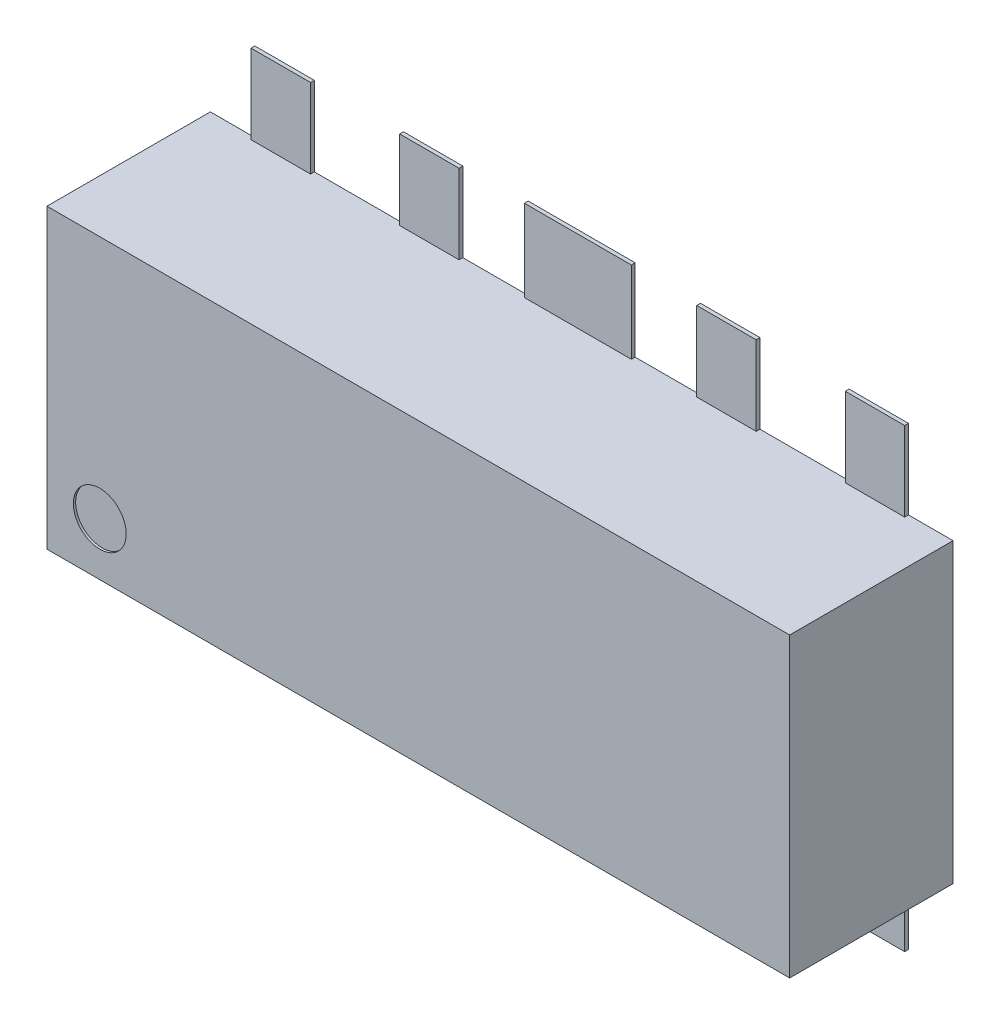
ISO-10303-21;
HEADER;
FILE_DESCRIPTION(('STEP AP214'),'2;1');
FILE_NAME('part.step','',(''),(''),'','','');
FILE_SCHEMA(('AUTOMOTIVE_DESIGN { 1 0 10303 214 1 1 1 1 }'));
ENDSEC;
DATA;
#1=APPLICATION_CONTEXT('core data for automotive mechanical design processes');
#2=APPLICATION_PROTOCOL_DEFINITION('international standard','automotive_design',2000,#1);
#3=PRODUCT_CONTEXT('',#1,'mechanical');
#4=PRODUCT('Part','Part','',(#3));
#5=PRODUCT_RELATED_PRODUCT_CATEGORY('part','',(#4));
#6=PRODUCT_DEFINITION_FORMATION('','',#4);
#7=PRODUCT_DEFINITION_CONTEXT('part definition',#1,'design');
#8=PRODUCT_DEFINITION('design','',#6,#7);
#9=PRODUCT_DEFINITION_SHAPE('','',#8);
#10=(LENGTH_UNIT() NAMED_UNIT(*) SI_UNIT(.MILLI.,.METRE.));
#11=(NAMED_UNIT(*) PLANE_ANGLE_UNIT() SI_UNIT($,.RADIAN.));
#12=(NAMED_UNIT(*) SI_UNIT($,.STERADIAN.) SOLID_ANGLE_UNIT());
#13=UNCERTAINTY_MEASURE_WITH_UNIT(LENGTH_MEASURE(1.E-05),#10,'distance_accuracy_value','');
#14=(GEOMETRIC_REPRESENTATION_CONTEXT(3) GLOBAL_UNCERTAINTY_ASSIGNED_CONTEXT((#13)) GLOBAL_UNIT_ASSIGNED_CONTEXT((#10,
#11,#12)) REPRESENTATION_CONTEXT('',''));
#15=CARTESIAN_POINT('',(0.,0.,0.));
#16=DIRECTION('',(0.,0.,1.));
#17=DIRECTION('',(1.,0.,0.));
#18=AXIS2_PLACEMENT_3D('',#15,#16,#17);
#19=CARTESIAN_POINT('',(0.,0.,0.61849));
#20=DIRECTION('',(0.,0.,1.));
#21=DIRECTION('',(1.,0.,0.));
#22=AXIS2_PLACEMENT_3D('',#19,#20,#21);
#23=PLANE('',#22);
#24=CARTESIAN_POINT('',(-1.07220000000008,-0.322200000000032,0.61849));
#25=DIRECTION('',(0.,0.,1.));
#26=DIRECTION('',(1.,0.,0.));
#27=AXIS2_PLACEMENT_3D('',#24,#25,#26);
#28=CIRCLE('',#27,0.0889);
#29=CARTESIAN_POINT('',(-0.98330000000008,-0.322200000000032,0.61849));
#30=VERTEX_POINT('',#29);
#31=EDGE_CURVE('E19',#30,#30,#28,.T.);
#32=ORIENTED_EDGE('',*,*,#31,.T.);
#33=EDGE_LOOP('',(#32));
#34=FACE_BOUND('',#33,.T.);
#35=ADVANCED_FACE('F16',(#34),#23,.T.);
#36=CARTESIAN_POINT('',(1.25000000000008,0.500000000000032,0.0762));
#37=DIRECTION('',(0.,1.,0.));
#38=DIRECTION('',(0.,0.,1.));
#39=AXIS2_PLACEMENT_3D('',#36,#37,#38);
#40=PLANE('',#39);
#41=DIRECTION('',(0.,0.,1.));
#42=VECTOR('',#41,1.);
#43=CARTESIAN_POINT('',(-0.8999982,0.500000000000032,0.0762));
#44=LINE('',#43,#42);
#45=CARTESIAN_POINT('',(-0.8999982,0.500000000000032,0.0762));
#46=VERTEX_POINT('',#45);
#47=CARTESIAN_POINT('',(-0.8999982,0.500000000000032,0.0889));
#48=VERTEX_POINT('',#47);
#49=EDGE_CURVE('E357',#46,#48,#44,.T.);
#50=ORIENTED_EDGE('',*,*,#49,.T.);
#51=DIRECTION('',(1.,0.,0.));
#52=VECTOR('',#51,1.);
#53=CARTESIAN_POINT('',(0.,0.500000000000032,0.0889));
#54=LINE('',#53,#52);
#55=CARTESIAN_POINT('',(-1.0999978,0.500000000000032,0.0889));
#56=VERTEX_POINT('',#55);
#57=EDGE_CURVE('E300',#56,#48,#54,.T.);
#58=ORIENTED_EDGE('',*,*,#57,.F.);
#59=DIRECTION('',(0.,0.,1.));
#60=VECTOR('',#59,1.);
#61=CARTESIAN_POINT('',(-1.0999978,0.500000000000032,0.0762));
#62=LINE('',#61,#60);
#63=CARTESIAN_POINT('',(-1.0999978,0.500000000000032,0.0762));
#64=VERTEX_POINT('',#63);
#65=EDGE_CURVE('E296',#56,#64,#62,.F.);
#66=ORIENTED_EDGE('',*,*,#65,.T.);
#67=DIRECTION('',(1.,0.,0.));
#68=VECTOR('',#67,1.);
#69=CARTESIAN_POINT('',(1.25000000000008,0.500000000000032,0.0762));
#70=LINE('',#69,#68);
#71=CARTESIAN_POINT('',(-1.25000000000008,0.500000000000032,0.0762));
#72=VERTEX_POINT('',#71);
#73=EDGE_CURVE('E293',#64,#72,#70,.F.);
#74=ORIENTED_EDGE('',*,*,#73,.T.);
#75=DIRECTION('',(0.,0.,1.));
#76=VECTOR('',#75,1.);
#77=CARTESIAN_POINT('',(-1.25000000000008,0.500000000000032,0.0762));
#78=LINE('',#77,#76);
#79=CARTESIAN_POINT('',(-1.25000000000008,0.500000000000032,0.62611));
#80=VERTEX_POINT('',#79);
#81=EDGE_CURVE('E320',#72,#80,#78,.T.);
#82=ORIENTED_EDGE('',*,*,#81,.T.);
#83=DIRECTION('',(1.,0.,0.));
#84=VECTOR('',#83,1.);
#85=CARTESIAN_POINT('',(0.,0.500000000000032,0.62611));
#86=LINE('',#85,#84);
#87=CARTESIAN_POINT('',(1.25000000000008,0.500000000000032,0.62611));
#88=VERTEX_POINT('',#87);
#89=EDGE_CURVE('E328',#88,#80,#86,.F.);
#90=ORIENTED_EDGE('',*,*,#89,.F.);
#91=DIRECTION('',(0.,0.,1.));
#92=VECTOR('',#91,1.);
#93=CARTESIAN_POINT('',(1.25000000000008,0.500000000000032,0.0762));
#94=LINE('',#93,#92);
#95=CARTESIAN_POINT('',(1.25000000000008,0.500000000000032,0.0762));
#96=VERTEX_POINT('',#95);
#97=EDGE_CURVE('E322',#88,#96,#94,.F.);
#98=ORIENTED_EDGE('',*,*,#97,.T.);
#99=DIRECTION('',(1.,0.,0.));
#100=VECTOR('',#99,1.);
#101=CARTESIAN_POINT('',(1.25000000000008,0.500000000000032,0.0762));
#102=LINE('',#101,#100);
#103=CARTESIAN_POINT('',(1.0999978,0.500000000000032,0.0762));
#104=VERTEX_POINT('',#103);
#105=EDGE_CURVE('E383',#96,#104,#102,.F.);
#106=ORIENTED_EDGE('',*,*,#105,.T.);
#107=DIRECTION('',(0.,0.,1.));
#108=VECTOR('',#107,1.);
#109=CARTESIAN_POINT('',(1.0999978,0.500000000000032,0.0762));
#110=LINE('',#109,#108);
#111=CARTESIAN_POINT('',(1.0999978,0.500000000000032,0.0889));
#112=VERTEX_POINT('',#111);
#113=EDGE_CURVE('E381',#104,#112,#110,.T.);
#114=ORIENTED_EDGE('',*,*,#113,.T.);
#115=DIRECTION('',(1.,0.,0.));
#116=VECTOR('',#115,1.);
#117=CARTESIAN_POINT('',(0.,0.500000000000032,0.0889));
#118=LINE('',#117,#116);
#119=CARTESIAN_POINT('',(0.8999982,0.500000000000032,0.0889));
#120=VERTEX_POINT('',#119);
#121=EDGE_CURVE('E354',#120,#112,#118,.T.);
#122=ORIENTED_EDGE('',*,*,#121,.F.);
#123=DIRECTION('',(0.,0.,1.));
#124=VECTOR('',#123,1.);
#125=CARTESIAN_POINT('',(0.8999982,0.500000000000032,0.0762));
#126=LINE('',#125,#124);
#127=CARTESIAN_POINT('',(0.8999982,0.500000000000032,0.0762));
#128=VERTEX_POINT('',#127);
#129=EDGE_CURVE('E379',#120,#128,#126,.F.);
#130=ORIENTED_EDGE('',*,*,#129,.T.);
#131=DIRECTION('',(1.,0.,0.));
#132=VECTOR('',#131,1.);
#133=CARTESIAN_POINT('',(1.25000000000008,0.500000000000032,0.0762));
#134=LINE('',#133,#132);
#135=CARTESIAN_POINT('',(0.5999988,0.500000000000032,0.0762));
#136=VERTEX_POINT('',#135);
#137=EDGE_CURVE('E377',#128,#136,#134,.F.);
#138=ORIENTED_EDGE('',*,*,#137,.T.);
#139=DIRECTION('',(0.,0.,1.));
#140=VECTOR('',#139,1.);
#141=CARTESIAN_POINT('',(0.5999988,0.500000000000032,0.0762));
#142=LINE('',#141,#140);
#143=CARTESIAN_POINT('',(0.5999988,0.500000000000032,0.0889));
#144=VERTEX_POINT('',#143);
#145=EDGE_CURVE('E375',#136,#144,#142,.T.);
#146=ORIENTED_EDGE('',*,*,#145,.T.);
#147=DIRECTION('',(1.,0.,0.));
#148=VECTOR('',#147,1.);
#149=CARTESIAN_POINT('',(0.,0.500000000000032,0.0889));
#150=LINE('',#149,#148);
#151=CARTESIAN_POINT('',(0.3999992,0.500000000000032,0.0889));
#152=VERTEX_POINT('',#151);
#153=EDGE_CURVE('E351',#152,#144,#150,.T.);
#154=ORIENTED_EDGE('',*,*,#153,.F.);
#155=DIRECTION('',(0.,0.,1.));
#156=VECTOR('',#155,1.);
#157=CARTESIAN_POINT('',(0.3999992,0.500000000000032,0.0762));
#158=LINE('',#157,#156);
#159=CARTESIAN_POINT('',(0.3999992,0.500000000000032,0.0762));
#160=VERTEX_POINT('',#159);
#161=EDGE_CURVE('E373',#152,#160,#158,.F.);
#162=ORIENTED_EDGE('',*,*,#161,.T.);
#163=DIRECTION('',(1.,0.,0.));
#164=VECTOR('',#163,1.);
#165=CARTESIAN_POINT('',(1.25000000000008,0.500000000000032,0.0762));
#166=LINE('',#165,#164);
#167=CARTESIAN_POINT('',(0.1800098,0.500000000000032,0.0762));
#168=VERTEX_POINT('',#167);
#169=EDGE_CURVE('E371',#160,#168,#166,.F.);
#170=ORIENTED_EDGE('',*,*,#169,.T.);
#171=DIRECTION('',(0.,0.,1.));
#172=VECTOR('',#171,1.);
#173=CARTESIAN_POINT('',(0.1800098,0.500000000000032,0.0762));
#174=LINE('',#173,#172);
#175=CARTESIAN_POINT('',(0.1800098,0.500000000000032,0.0889));
#176=VERTEX_POINT('',#175);
#177=EDGE_CURVE('E369',#168,#176,#174,.T.);
#178=ORIENTED_EDGE('',*,*,#177,.T.);
#179=DIRECTION('',(1.,0.,0.));
#180=VECTOR('',#179,1.);
#181=CARTESIAN_POINT('',(0.,0.500000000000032,0.0889));
#182=LINE('',#181,#180);
#183=CARTESIAN_POINT('',(-0.1800098,0.500000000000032,0.0889));
#184=VERTEX_POINT('',#183);
#185=EDGE_CURVE('E348',#184,#176,#182,.T.);
#186=ORIENTED_EDGE('',*,*,#185,.F.);
#187=DIRECTION('',(0.,0.,1.));
#188=VECTOR('',#187,1.);
#189=CARTESIAN_POINT('',(-0.1800098,0.500000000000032,0.0762));
#190=LINE('',#189,#188);
#191=CARTESIAN_POINT('',(-0.1800098,0.500000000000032,0.0762));
#192=VERTEX_POINT('',#191);
#193=EDGE_CURVE('E367',#184,#192,#190,.F.);
#194=ORIENTED_EDGE('',*,*,#193,.T.);
#195=DIRECTION('',(1.,0.,0.));
#196=VECTOR('',#195,1.);
#197=CARTESIAN_POINT('',(1.25000000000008,0.500000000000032,0.0762));
#198=LINE('',#197,#196);
#199=CARTESIAN_POINT('',(-0.3999992,0.500000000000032,0.0762));
#200=VERTEX_POINT('',#199);
#201=EDGE_CURVE('E365',#192,#200,#198,.F.);
#202=ORIENTED_EDGE('',*,*,#201,.T.);
#203=DIRECTION('',(0.,0.,1.));
#204=VECTOR('',#203,1.);
#205=CARTESIAN_POINT('',(-0.3999992,0.500000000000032,0.0762));
#206=LINE('',#205,#204);
#207=CARTESIAN_POINT('',(-0.3999992,0.500000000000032,0.0889));
#208=VERTEX_POINT('',#207);
#209=EDGE_CURVE('E363',#200,#208,#206,.T.);
#210=ORIENTED_EDGE('',*,*,#209,.T.);
#211=DIRECTION('',(1.,0.,0.));
#212=VECTOR('',#211,1.);
#213=CARTESIAN_POINT('',(0.,0.500000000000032,0.0889));
#214=LINE('',#213,#212);
#215=CARTESIAN_POINT('',(-0.5999988,0.500000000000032,0.0889));
#216=VERTEX_POINT('',#215);
#217=EDGE_CURVE('E345',#216,#208,#214,.T.);
#218=ORIENTED_EDGE('',*,*,#217,.F.);
#219=DIRECTION('',(0.,0.,1.));
#220=VECTOR('',#219,1.);
#221=CARTESIAN_POINT('',(-0.5999988,0.500000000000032,0.0762));
#222=LINE('',#221,#220);
#223=CARTESIAN_POINT('',(-0.5999988,0.500000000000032,0.0762));
#224=VERTEX_POINT('',#223);
#225=EDGE_CURVE('E361',#216,#224,#222,.F.);
#226=ORIENTED_EDGE('',*,*,#225,.T.);
#227=DIRECTION('',(1.,0.,0.));
#228=VECTOR('',#227,1.);
#229=CARTESIAN_POINT('',(1.25000000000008,0.500000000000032,0.0762));
#230=LINE('',#229,#228);
#231=EDGE_CURVE('E359',#224,#46,#230,.F.);
#232=ORIENTED_EDGE('',*,*,#231,.T.);
#233=EDGE_LOOP('',(#50,#58,#66,#74,#82,#90,#98,#106,#114,#122,#130,#138,#146,#154,#162,#170,
#178,#186,#194,#202,#210,#218,#226,#232));
#234=FACE_BOUND('',#233,.T.);
#235=ADVANCED_FACE('F298',(#234),#40,.T.);
#236=CARTESIAN_POINT('',(-1.07220000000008,-0.322200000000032,0.62611));
#237=DIRECTION('',(0.,0.,1.));
#238=DIRECTION('',(1.,0.,0.));
#239=AXIS2_PLACEMENT_3D('',#236,#237,#238);
#240=CYLINDRICAL_SURFACE('',#239,0.0889);
#241=ORIENTED_EDGE('',*,*,#31,.F.);
#242=EDGE_LOOP('',(#241));
#243=FACE_BOUND('',#242,.T.);
#244=CARTESIAN_POINT('',(-1.07220000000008,-0.322200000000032,0.62611));
#245=DIRECTION('',(0.,0.,1.));
#246=DIRECTION('',(1.,0.,0.));
#247=AXIS2_PLACEMENT_3D('',#244,#245,#246);
#248=CIRCLE('',#247,0.0889);
#249=CARTESIAN_POINT('',(-0.98330000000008,-0.322200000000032,0.62611));
#250=VERTEX_POINT('',#249);
#251=EDGE_CURVE('E325',#250,#250,#248,.F.);
#252=ORIENTED_EDGE('',*,*,#251,.F.);
#253=EDGE_LOOP('',(#252));
#254=FACE_BOUND('',#253,.T.);
#255=ADVANCED_FACE('F892',(#243,#254),#240,.F.);
#256=CARTESIAN_POINT('',(0.,0.,0.0889));
#257=DIRECTION('',(0.,0.,1.));
#258=DIRECTION('',(1.,0.,0.));
#259=AXIS2_PLACEMENT_3D('',#256,#257,#258);
#260=PLANE('',#259);
#261=DIRECTION('',(0.,1.,0.));
#262=VECTOR('',#261,1.);
#263=CARTESIAN_POINT('',(0.8999982,0.7670038,0.0889));
#264=LINE('',#263,#262);
#265=CARTESIAN_POINT('',(0.8999982,0.7670038,0.0889));
#266=VERTEX_POINT('',#265);
#267=EDGE_CURVE('E406',#120,#266,#264,.T.);
#268=ORIENTED_EDGE('',*,*,#267,.F.);
#269=ORIENTED_EDGE('',*,*,#121,.T.);
#270=DIRECTION('',(0.,1.,0.));
#271=VECTOR('',#270,1.);
#272=CARTESIAN_POINT('',(1.0999978,0.1070102,0.0889));
#273=LINE('',#272,#271);
#274=CARTESIAN_POINT('',(1.0999978,0.7670038,0.0889));
#275=VERTEX_POINT('',#274);
#276=EDGE_CURVE('E327',#275,#112,#273,.F.);
#277=ORIENTED_EDGE('',*,*,#276,.F.);
#278=DIRECTION('',(1.,0.,0.));
#279=VECTOR('',#278,1.);
#280=CARTESIAN_POINT('',(1.0999978,0.7670038,0.0889));
#281=LINE('',#280,#279);
#282=EDGE_CURVE('E332',#266,#275,#281,.T.);
#283=ORIENTED_EDGE('',*,*,#282,.F.);
#284=EDGE_LOOP('',(#268,#269,#277,#283));
#285=FACE_BOUND('',#284,.T.);
#286=ADVANCED_FACE('F404',(#285),#260,.T.);
#287=CARTESIAN_POINT('',(0.,0.,0.0889));
#288=DIRECTION('',(0.,0.,1.));
#289=DIRECTION('',(1.,0.,0.));
#290=AXIS2_PLACEMENT_3D('',#287,#288,#289);
#291=PLANE('',#290);
#292=DIRECTION('',(0.,1.,0.));
#293=VECTOR('',#292,1.);
#294=CARTESIAN_POINT('',(0.3999992,0.7670038,0.0889));
#295=LINE('',#294,#293);
#296=CARTESIAN_POINT('',(0.3999992,0.7670038,0.0889));
#297=VERTEX_POINT('',#296);
#298=EDGE_CURVE('E558',#152,#297,#295,.T.);
#299=ORIENTED_EDGE('',*,*,#298,.F.);
#300=ORIENTED_EDGE('',*,*,#153,.T.);
#301=DIRECTION('',(0.,1.,0.));
#302=VECTOR('',#301,1.);
#303=CARTESIAN_POINT('',(0.5999988,0.1070102,0.0889));
#304=LINE('',#303,#302);
#305=CARTESIAN_POINT('',(0.5999988,0.7670038,0.0889));
#306=VERTEX_POINT('',#305);
#307=EDGE_CURVE('E412',#306,#144,#304,.F.);
#308=ORIENTED_EDGE('',*,*,#307,.F.);
#309=DIRECTION('',(1.,0.,0.));
#310=VECTOR('',#309,1.);
#311=CARTESIAN_POINT('',(0.5999988,0.7670038,0.0889));
#312=LINE('',#311,#310);
#313=EDGE_CURVE('E562',#297,#306,#312,.T.);
#314=ORIENTED_EDGE('',*,*,#313,.F.);
#315=EDGE_LOOP('',(#299,#300,#308,#314));
#316=FACE_BOUND('',#315,.T.);
#317=ADVANCED_FACE('F572',(#316),#291,.T.);
#318=CARTESIAN_POINT('',(0.,0.,0.0889));
#319=DIRECTION('',(0.,0.,1.));
#320=DIRECTION('',(1.,0.,0.));
#321=AXIS2_PLACEMENT_3D('',#318,#319,#320);
#322=PLANE('',#321);
#323=DIRECTION('',(0.,1.,0.));
#324=VECTOR('',#323,1.);
#325=CARTESIAN_POINT('',(-0.1800098,0.7750048,0.0889));
#326=LINE('',#325,#324);
#327=CARTESIAN_POINT('',(-0.1800098,0.7750048,0.0889));
#328=VERTEX_POINT('',#327);
#329=EDGE_CURVE('E547',#184,#328,#326,.T.);
#330=ORIENTED_EDGE('',*,*,#329,.F.);
#331=ORIENTED_EDGE('',*,*,#185,.T.);
#332=DIRECTION('',(0.,1.,0.));
#333=VECTOR('',#332,1.);
#334=CARTESIAN_POINT('',(0.1800098,-0.7750048,0.0889));
#335=LINE('',#334,#333);
#336=CARTESIAN_POINT('',(0.1800098,0.7750048,0.0889));
#337=VERTEX_POINT('',#336);
#338=EDGE_CURVE('E553',#337,#176,#335,.F.);
#339=ORIENTED_EDGE('',*,*,#338,.F.);
#340=DIRECTION('',(1.,0.,0.));
#341=VECTOR('',#340,1.);
#342=CARTESIAN_POINT('',(0.1800098,0.7750048,0.0889));
#343=LINE('',#342,#341);
#344=EDGE_CURVE('E551',#328,#337,#343,.T.);
#345=ORIENTED_EDGE('',*,*,#344,.F.);
#346=EDGE_LOOP('',(#330,#331,#339,#345));
#347=FACE_BOUND('',#346,.T.);
#348=ADVANCED_FACE('F883',(#347),#322,.T.);
#349=CARTESIAN_POINT('',(0.,0.,0.0889));
#350=DIRECTION('',(0.,0.,1.));
#351=DIRECTION('',(1.,0.,0.));
#352=AXIS2_PLACEMENT_3D('',#349,#350,#351);
#353=PLANE('',#352);
#354=DIRECTION('',(0.,1.,0.));
#355=VECTOR('',#354,1.);
#356=CARTESIAN_POINT('',(-0.5999988,0.7670038,0.0889));
#357=LINE('',#356,#355);
#358=CARTESIAN_POINT('',(-0.5999988,0.7670038,0.0889));
#359=VERTEX_POINT('',#358);
#360=EDGE_CURVE('E536',#216,#359,#357,.T.);
#361=ORIENTED_EDGE('',*,*,#360,.F.);
#362=ORIENTED_EDGE('',*,*,#217,.T.);
#363=DIRECTION('',(0.,1.,0.));
#364=VECTOR('',#363,1.);
#365=CARTESIAN_POINT('',(-0.3999992,0.1070102,0.0889));
#366=LINE('',#365,#364);
#367=CARTESIAN_POINT('',(-0.3999992,0.7670038,0.0889));
#368=VERTEX_POINT('',#367);
#369=EDGE_CURVE('E542',#368,#208,#366,.F.);
#370=ORIENTED_EDGE('',*,*,#369,.F.);
#371=DIRECTION('',(1.,0.,0.));
#372=VECTOR('',#371,1.);
#373=CARTESIAN_POINT('',(-0.3999992,0.7670038,0.0889));
#374=LINE('',#373,#372);
#375=EDGE_CURVE('E540',#359,#368,#374,.T.);
#376=ORIENTED_EDGE('',*,*,#375,.F.);
#377=EDGE_LOOP('',(#361,#362,#370,#376));
#378=FACE_BOUND('',#377,.T.);
#379=ADVANCED_FACE('F879',(#378),#353,.T.);
#380=CARTESIAN_POINT('',(0.,0.,0.0889));
#381=DIRECTION('',(0.,0.,1.));
#382=DIRECTION('',(1.,0.,0.));
#383=AXIS2_PLACEMENT_3D('',#380,#381,#382);
#384=PLANE('',#383);
#385=DIRECTION('',(0.,1.,0.));
#386=VECTOR('',#385,1.);
#387=CARTESIAN_POINT('',(-1.0999978,0.7670038,0.0889));
#388=LINE('',#387,#386);
#389=CARTESIAN_POINT('',(-1.0999978,0.7670038,0.0889));
#390=VERTEX_POINT('',#389);
#391=EDGE_CURVE('E525',#56,#390,#388,.T.);
#392=ORIENTED_EDGE('',*,*,#391,.F.);
#393=ORIENTED_EDGE('',*,*,#57,.T.);
#394=DIRECTION('',(0.,1.,0.));
#395=VECTOR('',#394,1.);
#396=CARTESIAN_POINT('',(-0.8999982,0.1070102,0.0889));
#397=LINE('',#396,#395);
#398=CARTESIAN_POINT('',(-0.8999982,0.7670038,0.0889));
#399=VERTEX_POINT('',#398);
#400=EDGE_CURVE('E531',#399,#48,#397,.F.);
#401=ORIENTED_EDGE('',*,*,#400,.F.);
#402=DIRECTION('',(1.,0.,0.));
#403=VECTOR('',#402,1.);
#404=CARTESIAN_POINT('',(-0.8999982,0.7670038,0.0889));
#405=LINE('',#404,#403);
#406=EDGE_CURVE('E529',#390,#399,#405,.T.);
#407=ORIENTED_EDGE('',*,*,#406,.F.);
#408=EDGE_LOOP('',(#392,#393,#401,#407));
#409=FACE_BOUND('',#408,.T.);
#410=ADVANCED_FACE('F874',(#409),#384,.T.);
#411=CARTESIAN_POINT('',(0.,0.,0.0889));
#412=DIRECTION('',(0.,0.,1.));
#413=DIRECTION('',(1.,0.,0.));
#414=AXIS2_PLACEMENT_3D('',#411,#412,#413);
#415=PLANE('',#414);
#416=DIRECTION('',(0.,1.,0.));
#417=VECTOR('',#416,1.);
#418=CARTESIAN_POINT('',(-0.3999992,-0.7670038,0.0889));
#419=LINE('',#418,#417);
#420=CARTESIAN_POINT('',(-0.3999992,-0.500000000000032,0.0889));
#421=VERTEX_POINT('',#420);
#422=CARTESIAN_POINT('',(-0.3999992,-0.7670038,0.0889));
#423=VERTEX_POINT('',#422);
#424=EDGE_CURVE('E504',#421,#423,#419,.F.);
#425=ORIENTED_EDGE('',*,*,#424,.F.);
#426=DIRECTION('',(1.,0.,0.));
#427=VECTOR('',#426,1.);
#428=CARTESIAN_POINT('',(-1.25000000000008,-0.500000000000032,0.0889));
#429=LINE('',#428,#427);
#430=CARTESIAN_POINT('',(-0.5999988,-0.500000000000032,0.0889));
#431=VERTEX_POINT('',#430);
#432=EDGE_CURVE('E465',#431,#421,#429,.T.);
#433=ORIENTED_EDGE('',*,*,#432,.F.);
#434=DIRECTION('',(0.,1.,0.));
#435=VECTOR('',#434,1.);
#436=CARTESIAN_POINT('',(-0.5999988,-0.1070102,0.0889));
#437=LINE('',#436,#435);
#438=CARTESIAN_POINT('',(-0.5999988,-0.7670038,0.0889));
#439=VERTEX_POINT('',#438);
#440=EDGE_CURVE('E510',#439,#431,#437,.T.);
#441=ORIENTED_EDGE('',*,*,#440,.F.);
#442=DIRECTION('',(1.,0.,0.));
#443=VECTOR('',#442,1.);
#444=CARTESIAN_POINT('',(-0.5999988,-0.7670038,0.0889));
#445=LINE('',#444,#443);
#446=EDGE_CURVE('E508',#423,#439,#445,.F.);
#447=ORIENTED_EDGE('',*,*,#446,.F.);
#448=EDGE_LOOP('',(#425,#433,#441,#447));
#449=FACE_BOUND('',#448,.T.);
#450=ADVANCED_FACE('F840',(#449),#415,.T.);
#451=CARTESIAN_POINT('',(0.,0.,0.0889));
#452=DIRECTION('',(0.,0.,1.));
#453=DIRECTION('',(1.,0.,0.));
#454=AXIS2_PLACEMENT_3D('',#451,#452,#453);
#455=PLANE('',#454);
#456=DIRECTION('',(0.,1.,0.));
#457=VECTOR('',#456,1.);
#458=CARTESIAN_POINT('',(0.1800098,-0.7750048,0.0889));
#459=LINE('',#458,#457);
#460=CARTESIAN_POINT('',(0.1800098,-0.500000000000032,0.0889));
#461=VERTEX_POINT('',#460);
#462=CARTESIAN_POINT('',(0.1800098,-0.7750048,0.0889));
#463=VERTEX_POINT('',#462);
#464=EDGE_CURVE('E494',#461,#463,#459,.F.);
#465=ORIENTED_EDGE('',*,*,#464,.F.);
#466=DIRECTION('',(1.,0.,0.));
#467=VECTOR('',#466,1.);
#468=CARTESIAN_POINT('',(-1.25000000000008,-0.500000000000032,0.0889));
#469=LINE('',#468,#467);
#470=CARTESIAN_POINT('',(-0.1800098,-0.500000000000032,0.0889));
#471=VERTEX_POINT('',#470);
#472=EDGE_CURVE('E458',#471,#461,#469,.T.);
#473=ORIENTED_EDGE('',*,*,#472,.F.);
#474=DIRECTION('',(0.,1.,0.));
#475=VECTOR('',#474,1.);
#476=CARTESIAN_POINT('',(-0.1800098,0.7750048,0.0889));
#477=LINE('',#476,#475);
#478=CARTESIAN_POINT('',(-0.1800098,-0.7750048,0.0889));
#479=VERTEX_POINT('',#478);
#480=EDGE_CURVE('E500',#479,#471,#477,.T.);
#481=ORIENTED_EDGE('',*,*,#480,.F.);
#482=DIRECTION('',(1.,0.,0.));
#483=VECTOR('',#482,1.);
#484=CARTESIAN_POINT('',(-0.1800098,-0.7750048,0.0889));
#485=LINE('',#484,#483);
#486=EDGE_CURVE('E498',#463,#479,#485,.F.);
#487=ORIENTED_EDGE('',*,*,#486,.F.);
#488=EDGE_LOOP('',(#465,#473,#481,#487));
#489=FACE_BOUND('',#488,.T.);
#490=ADVANCED_FACE('F699',(#489),#455,.T.);
#491=CARTESIAN_POINT('',(0.,0.,0.0889));
#492=DIRECTION('',(0.,0.,1.));
#493=DIRECTION('',(1.,0.,0.));
#494=AXIS2_PLACEMENT_3D('',#491,#492,#493);
#495=PLANE('',#494);
#496=DIRECTION('',(0.,1.,0.));
#497=VECTOR('',#496,1.);
#498=CARTESIAN_POINT('',(0.5999988,-0.7670038,0.0889));
#499=LINE('',#498,#497);
#500=CARTESIAN_POINT('',(0.5999988,-0.500000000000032,0.0889));
#501=VERTEX_POINT('',#500);
#502=CARTESIAN_POINT('',(0.5999988,-0.7670038,0.0889));
#503=VERTEX_POINT('',#502);
#504=EDGE_CURVE('E484',#501,#503,#499,.F.);
#505=ORIENTED_EDGE('',*,*,#504,.F.);
#506=DIRECTION('',(1.,0.,0.));
#507=VECTOR('',#506,1.);
#508=CARTESIAN_POINT('',(-1.25000000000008,-0.500000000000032,0.0889));
#509=LINE('',#508,#507);
#510=CARTESIAN_POINT('',(0.3999992,-0.500000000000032,0.0889));
#511=VERTEX_POINT('',#510);
#512=EDGE_CURVE('E451',#511,#501,#509,.T.);
#513=ORIENTED_EDGE('',*,*,#512,.F.);
#514=DIRECTION('',(0.,1.,0.));
#515=VECTOR('',#514,1.);
#516=CARTESIAN_POINT('',(0.3999992,-0.1070102,0.0889));
#517=LINE('',#516,#515);
#518=CARTESIAN_POINT('',(0.3999992,-0.7670038,0.0889));
#519=VERTEX_POINT('',#518);
#520=EDGE_CURVE('E490',#519,#511,#517,.T.);
#521=ORIENTED_EDGE('',*,*,#520,.F.);
#522=DIRECTION('',(1.,0.,0.));
#523=VECTOR('',#522,1.);
#524=CARTESIAN_POINT('',(0.3999992,-0.7670038,0.0889));
#525=LINE('',#524,#523);
#526=EDGE_CURVE('E488',#503,#519,#525,.F.);
#527=ORIENTED_EDGE('',*,*,#526,.F.);
#528=EDGE_LOOP('',(#505,#513,#521,#527));
#529=FACE_BOUND('',#528,.T.);
#530=ADVANCED_FACE('F690',(#529),#495,.T.);
#531=CARTESIAN_POINT('',(0.,0.,0.0889));
#532=DIRECTION('',(0.,0.,1.));
#533=DIRECTION('',(1.,0.,0.));
#534=AXIS2_PLACEMENT_3D('',#531,#532,#533);
#535=PLANE('',#534);
#536=DIRECTION('',(0.,1.,0.));
#537=VECTOR('',#536,1.);
#538=CARTESIAN_POINT('',(1.0999978,-0.7670038,0.0889));
#539=LINE('',#538,#537);
#540=CARTESIAN_POINT('',(1.0999978,-0.500000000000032,0.0889));
#541=VERTEX_POINT('',#540);
#542=CARTESIAN_POINT('',(1.0999978,-0.7670038,0.0889));
#543=VERTEX_POINT('',#542);
#544=EDGE_CURVE('E474',#541,#543,#539,.F.);
#545=ORIENTED_EDGE('',*,*,#544,.F.);
#546=DIRECTION('',(1.,0.,0.));
#547=VECTOR('',#546,1.);
#548=CARTESIAN_POINT('',(-1.25000000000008,-0.500000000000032,0.0889));
#549=LINE('',#548,#547);
#550=CARTESIAN_POINT('',(0.8999982,-0.500000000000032,0.0889));
#551=VERTEX_POINT('',#550);
#552=EDGE_CURVE('E444',#551,#541,#549,.T.);
#553=ORIENTED_EDGE('',*,*,#552,.F.);
#554=DIRECTION('',(0.,1.,0.));
#555=VECTOR('',#554,1.);
#556=CARTESIAN_POINT('',(0.8999982,-0.1070102,0.0889));
#557=LINE('',#556,#555);
#558=CARTESIAN_POINT('',(0.8999982,-0.7670038,0.0889));
#559=VERTEX_POINT('',#558);
#560=EDGE_CURVE('E480',#559,#551,#557,.T.);
#561=ORIENTED_EDGE('',*,*,#560,.F.);
#562=DIRECTION('',(1.,0.,0.));
#563=VECTOR('',#562,1.);
#564=CARTESIAN_POINT('',(0.8999982,-0.7670038,0.0889));
#565=LINE('',#564,#563);
#566=EDGE_CURVE('E478',#543,#559,#565,.F.);
#567=ORIENTED_EDGE('',*,*,#566,.F.);
#568=EDGE_LOOP('',(#545,#553,#561,#567));
#569=FACE_BOUND('',#568,.T.);
#570=ADVANCED_FACE('F687',(#569),#535,.T.);
#571=CARTESIAN_POINT('',(0.,0.,0.62611));
#572=DIRECTION('',(0.,0.,1.));
#573=DIRECTION('',(1.,0.,0.));
#574=AXIS2_PLACEMENT_3D('',#571,#572,#573);
#575=PLANE('',#574);
#576=ORIENTED_EDGE('',*,*,#251,.T.);
#577=EDGE_LOOP('',(#576));
#578=FACE_BOUND('',#577,.T.);
#579=ORIENTED_EDGE('',*,*,#89,.T.);
#580=DIRECTION('',(0.,1.,0.));
#581=VECTOR('',#580,1.);
#582=CARTESIAN_POINT('',(-1.25000000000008,0.500000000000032,0.62611));
#583=LINE('',#582,#581);
#584=CARTESIAN_POINT('',(-1.25000000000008,-0.500000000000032,0.62611));
#585=VERTEX_POINT('',#584);
#586=EDGE_CURVE('E522',#585,#80,#583,.T.);
#587=ORIENTED_EDGE('',*,*,#586,.F.);
#588=DIRECTION('',(1.,0.,0.));
#589=VECTOR('',#588,1.);
#590=CARTESIAN_POINT('',(-1.25000000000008,-0.500000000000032,0.62611));
#591=LINE('',#590,#589);
#592=CARTESIAN_POINT('',(1.25000000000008,-0.500000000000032,0.62611));
#593=VERTEX_POINT('',#592);
#594=EDGE_CURVE('E440',#593,#585,#591,.F.);
#595=ORIENTED_EDGE('',*,*,#594,.F.);
#596=DIRECTION('',(0.,1.,0.));
#597=VECTOR('',#596,1.);
#598=CARTESIAN_POINT('',(1.25000000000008,0.,0.62611));
#599=LINE('',#598,#597);
#600=EDGE_CURVE('E335',#593,#88,#599,.T.);
#601=ORIENTED_EDGE('',*,*,#600,.T.);
#602=EDGE_LOOP('',(#579,#587,#595,#601));
#603=FACE_BOUND('',#602,.T.);
#604=ADVANCED_FACE('F689',(#578,#603),#575,.T.);
#605=CARTESIAN_POINT('',(0.,0.,0.0889));
#606=DIRECTION('',(0.,0.,1.));
#607=DIRECTION('',(1.,0.,0.));
#608=AXIS2_PLACEMENT_3D('',#605,#606,#607);
#609=PLANE('',#608);
#610=DIRECTION('',(0.,1.,0.));
#611=VECTOR('',#610,1.);
#612=CARTESIAN_POINT('',(-0.8999982,-0.7670038,0.0889));
#613=LINE('',#612,#611);
#614=CARTESIAN_POINT('',(-0.8999982,-0.500000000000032,0.0889));
#615=VERTEX_POINT('',#614);
#616=CARTESIAN_POINT('',(-0.8999982,-0.7670038,0.0889));
#617=VERTEX_POINT('',#616);
#618=EDGE_CURVE('E514',#615,#617,#613,.F.);
#619=ORIENTED_EDGE('',*,*,#618,.F.);
#620=DIRECTION('',(1.,0.,0.));
#621=VECTOR('',#620,1.);
#622=CARTESIAN_POINT('',(-1.25000000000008,-0.500000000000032,0.0889));
#623=LINE('',#622,#621);
#624=CARTESIAN_POINT('',(-1.0999978,-0.500000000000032,0.0889));
#625=VERTEX_POINT('',#624);
#626=EDGE_CURVE('E432',#625,#615,#623,.T.);
#627=ORIENTED_EDGE('',*,*,#626,.F.);
#628=DIRECTION('',(0.,1.,0.));
#629=VECTOR('',#628,1.);
#630=CARTESIAN_POINT('',(-1.0999978,-0.1070102,0.0889));
#631=LINE('',#630,#629);
#632=CARTESIAN_POINT('',(-1.0999978,-0.7670038,0.0889));
#633=VERTEX_POINT('',#632);
#634=EDGE_CURVE('E520',#633,#625,#631,.T.);
#635=ORIENTED_EDGE('',*,*,#634,.F.);
#636=DIRECTION('',(1.,0.,0.));
#637=VECTOR('',#636,1.);
#638=CARTESIAN_POINT('',(-1.0999978,-0.7670038,0.0889));
#639=LINE('',#638,#637);
#640=EDGE_CURVE('E518',#617,#633,#639,.F.);
#641=ORIENTED_EDGE('',*,*,#640,.F.);
#642=EDGE_LOOP('',(#619,#627,#635,#641));
#643=FACE_BOUND('',#642,.T.);
#644=ADVANCED_FACE('F697',(#643),#609,.T.);
#645=CARTESIAN_POINT('',(1.0999978,0.1070102,0.0762));
#646=DIRECTION('',(1.,0.,0.));
#647=DIRECTION('',(0.,0.,-1.));
#648=AXIS2_PLACEMENT_3D('',#645,#646,#647);
#649=PLANE('',#648);
#650=ORIENTED_EDGE('',*,*,#276,.T.);
#651=ORIENTED_EDGE('',*,*,#113,.F.);
#652=DIRECTION('',(0.,1.,0.));
#653=VECTOR('',#652,1.);
#654=CARTESIAN_POINT('',(1.0999978,0.,0.0762));
#655=LINE('',#654,#653);
#656=CARTESIAN_POINT('',(1.0999978,0.7670038,0.0762));
#657=VERTEX_POINT('',#656);
#658=EDGE_CURVE('E391',#104,#657,#655,.T.);
#659=ORIENTED_EDGE('',*,*,#658,.T.);
#660=DIRECTION('',(0.,0.,1.));
#661=VECTOR('',#660,1.);
#662=CARTESIAN_POINT('',(1.0999978,0.7670038,0.0762));
#663=LINE('',#662,#661);
#664=EDGE_CURVE('E410',#275,#657,#663,.F.);
#665=ORIENTED_EDGE('',*,*,#664,.F.);
#666=EDGE_LOOP('',(#650,#651,#659,#665));
#667=FACE_BOUND('',#666,.T.);
#668=ADVANCED_FACE('F399',(#667),#649,.T.);
#669=CARTESIAN_POINT('',(1.0999978,0.7670038,0.0762));
#670=DIRECTION('',(0.,1.,0.));
#671=DIRECTION('',(0.,0.,1.));
#672=AXIS2_PLACEMENT_3D('',#669,#670,#671);
#673=PLANE('',#672);
#674=ORIENTED_EDGE('',*,*,#664,.T.);
#675=DIRECTION('',(1.,0.,0.));
#676=VECTOR('',#675,1.);
#677=CARTESIAN_POINT('',(0.,0.7670038,0.0762));
#678=LINE('',#677,#676);
#679=CARTESIAN_POINT('',(0.8999982,0.7670038,0.0762));
#680=VERTEX_POINT('',#679);
#681=EDGE_CURVE('E395',#657,#680,#678,.F.);
#682=ORIENTED_EDGE('',*,*,#681,.T.);
#683=DIRECTION('',(0.,0.,1.));
#684=VECTOR('',#683,1.);
#685=CARTESIAN_POINT('',(0.8999982,0.7670038,0.0762));
#686=LINE('',#685,#684);
#687=EDGE_CURVE('E409',#266,#680,#686,.F.);
#688=ORIENTED_EDGE('',*,*,#687,.F.);
#689=ORIENTED_EDGE('',*,*,#282,.T.);
#690=EDGE_LOOP('',(#674,#682,#688,#689));
#691=FACE_BOUND('',#690,.T.);
#692=ADVANCED_FACE('F417',(#691),#673,.T.);
#693=CARTESIAN_POINT('',(0.8999982,0.7670038,0.0762));
#694=DIRECTION('',(-1.,0.,0.));
#695=DIRECTION('',(0.,0.,1.));
#696=AXIS2_PLACEMENT_3D('',#693,#694,#695);
#697=PLANE('',#696);
#698=DIRECTION('',(0.,1.,0.));
#699=VECTOR('',#698,1.);
#700=CARTESIAN_POINT('',(0.8999982,0.,0.0762));
#701=LINE('',#700,#699);
#702=EDGE_CURVE('E420',#680,#128,#701,.F.);
#703=ORIENTED_EDGE('',*,*,#702,.T.);
#704=ORIENTED_EDGE('',*,*,#129,.F.);
#705=ORIENTED_EDGE('',*,*,#267,.T.);
#706=ORIENTED_EDGE('',*,*,#687,.T.);
#707=EDGE_LOOP('',(#703,#704,#705,#706));
#708=FACE_BOUND('',#707,.T.);
#709=ADVANCED_FACE('F419',(#708),#697,.T.);
#710=CARTESIAN_POINT('',(0.5999988,0.1070102,0.0762));
#711=DIRECTION('',(1.,0.,0.));
#712=DIRECTION('',(0.,0.,-1.));
#713=AXIS2_PLACEMENT_3D('',#710,#711,#712);
#714=PLANE('',#713);
#715=ORIENTED_EDGE('',*,*,#307,.T.);
#716=ORIENTED_EDGE('',*,*,#145,.F.);
#717=DIRECTION('',(0.,1.,0.));
#718=VECTOR('',#717,1.);
#719=CARTESIAN_POINT('',(0.5999988,0.,0.0762));
#720=LINE('',#719,#718);
#721=CARTESIAN_POINT('',(0.5999988,0.7670038,0.0762));
#722=VERTEX_POINT('',#721);
#723=EDGE_CURVE('E423',#136,#722,#720,.T.);
#724=ORIENTED_EDGE('',*,*,#723,.T.);
#725=DIRECTION('',(0.,0.,1.));
#726=VECTOR('',#725,1.);
#727=CARTESIAN_POINT('',(0.5999988,0.7670038,0.0762));
#728=LINE('',#727,#726);
#729=EDGE_CURVE('E560',#306,#722,#728,.F.);
#730=ORIENTED_EDGE('',*,*,#729,.F.);
#731=EDGE_LOOP('',(#715,#716,#724,#730));
#732=FACE_BOUND('',#731,.T.);
#733=ADVANCED_FACE('F568',(#732),#714,.T.);
#734=CARTESIAN_POINT('',(0.5999988,0.7670038,0.0762));
#735=DIRECTION('',(0.,1.,0.));
#736=DIRECTION('',(0.,0.,1.));
#737=AXIS2_PLACEMENT_3D('',#734,#735,#736);
#738=PLANE('',#737);
#739=ORIENTED_EDGE('',*,*,#729,.T.);
#740=DIRECTION('',(1.,0.,0.));
#741=VECTOR('',#740,1.);
#742=CARTESIAN_POINT('',(0.,0.7670038,0.0762));
#743=LINE('',#742,#741);
#744=CARTESIAN_POINT('',(0.3999992,0.7670038,0.0762));
#745=VERTEX_POINT('',#744);
#746=EDGE_CURVE('E426',#722,#745,#743,.F.);
#747=ORIENTED_EDGE('',*,*,#746,.T.);
#748=DIRECTION('',(0.,0.,1.));
#749=VECTOR('',#748,1.);
#750=CARTESIAN_POINT('',(0.3999992,0.7670038,0.0762));
#751=LINE('',#750,#749);
#752=EDGE_CURVE('E556',#297,#745,#751,.F.);
#753=ORIENTED_EDGE('',*,*,#752,.F.);
#754=ORIENTED_EDGE('',*,*,#313,.T.);
#755=EDGE_LOOP('',(#739,#747,#753,#754));
#756=FACE_BOUND('',#755,.T.);
#757=ADVANCED_FACE('F806',(#756),#738,.T.);
#758=CARTESIAN_POINT('',(0.3999992,0.7670038,0.0762));
#759=DIRECTION('',(-1.,0.,0.));
#760=DIRECTION('',(0.,0.,1.));
#761=AXIS2_PLACEMENT_3D('',#758,#759,#760);
#762=PLANE('',#761);
#763=DIRECTION('',(0.,1.,0.));
#764=VECTOR('',#763,1.);
#765=CARTESIAN_POINT('',(0.3999992,0.,0.0762));
#766=LINE('',#765,#764);
#767=EDGE_CURVE('E580',#745,#160,#766,.F.);
#768=ORIENTED_EDGE('',*,*,#767,.T.);
#769=ORIENTED_EDGE('',*,*,#161,.F.);
#770=ORIENTED_EDGE('',*,*,#298,.T.);
#771=ORIENTED_EDGE('',*,*,#752,.T.);
#772=EDGE_LOOP('',(#768,#769,#770,#771));
#773=FACE_BOUND('',#772,.T.);
#774=ADVANCED_FACE('F802',(#773),#762,.T.);
#775=CARTESIAN_POINT('',(0.1800098,-0.7750048,0.0762));
#776=DIRECTION('',(1.,0.,0.));
#777=DIRECTION('',(0.,0.,-1.));
#778=AXIS2_PLACEMENT_3D('',#775,#776,#777);
#779=PLANE('',#778);
#780=ORIENTED_EDGE('',*,*,#338,.T.);
#781=ORIENTED_EDGE('',*,*,#177,.F.);
#782=DIRECTION('',(0.,1.,0.));
#783=VECTOR('',#782,1.);
#784=CARTESIAN_POINT('',(0.1800098,0.,0.0762));
#785=LINE('',#784,#783);
#786=CARTESIAN_POINT('',(0.1800098,0.7750048,0.0762));
#787=VERTEX_POINT('',#786);
#788=EDGE_CURVE('E582',#168,#787,#785,.T.);
#789=ORIENTED_EDGE('',*,*,#788,.T.);
#790=DIRECTION('',(0.,0.,1.));
#791=VECTOR('',#790,1.);
#792=CARTESIAN_POINT('',(0.1800098,0.7750048,0.0762));
#793=LINE('',#792,#791);
#794=EDGE_CURVE('E549',#337,#787,#793,.F.);
#795=ORIENTED_EDGE('',*,*,#794,.F.);
#796=EDGE_LOOP('',(#780,#781,#789,#795));
#797=FACE_BOUND('',#796,.T.);
#798=ADVANCED_FACE('F798',(#797),#779,.T.);
#799=CARTESIAN_POINT('',(0.1800098,0.7750048,0.0762));
#800=DIRECTION('',(0.,1.,0.));
#801=DIRECTION('',(0.,0.,1.));
#802=AXIS2_PLACEMENT_3D('',#799,#800,#801);
#803=PLANE('',#802);
#804=ORIENTED_EDGE('',*,*,#794,.T.);
#805=DIRECTION('',(1.,0.,0.));
#806=VECTOR('',#805,1.);
#807=CARTESIAN_POINT('',(0.,0.7750048,0.0762));
#808=LINE('',#807,#806);
#809=CARTESIAN_POINT('',(-0.1800098,0.7750048,0.0762));
#810=VERTEX_POINT('',#809);
#811=EDGE_CURVE('E587',#787,#810,#808,.F.);
#812=ORIENTED_EDGE('',*,*,#811,.T.);
#813=DIRECTION('',(0.,0.,1.));
#814=VECTOR('',#813,1.);
#815=CARTESIAN_POINT('',(-0.1800098,0.7750048,0.0762));
#816=LINE('',#815,#814);
#817=EDGE_CURVE('E545',#328,#810,#816,.F.);
#818=ORIENTED_EDGE('',*,*,#817,.F.);
#819=ORIENTED_EDGE('',*,*,#344,.T.);
#820=EDGE_LOOP('',(#804,#812,#818,#819));
#821=FACE_BOUND('',#820,.T.);
#822=ADVANCED_FACE('F794',(#821),#803,.T.);
#823=CARTESIAN_POINT('',(-0.1800098,0.7750048,0.0762));
#824=DIRECTION('',(-1.,0.,0.));
#825=DIRECTION('',(0.,0.,1.));
#826=AXIS2_PLACEMENT_3D('',#823,#824,#825);
#827=PLANE('',#826);
#828=DIRECTION('',(0.,1.,0.));
#829=VECTOR('',#828,1.);
#830=CARTESIAN_POINT('',(-0.1800098,0.,0.0762));
#831=LINE('',#830,#829);
#832=EDGE_CURVE('E590',#810,#192,#831,.F.);
#833=ORIENTED_EDGE('',*,*,#832,.T.);
#834=ORIENTED_EDGE('',*,*,#193,.F.);
#835=ORIENTED_EDGE('',*,*,#329,.T.);
#836=ORIENTED_EDGE('',*,*,#817,.T.);
#837=EDGE_LOOP('',(#833,#834,#835,#836));
#838=FACE_BOUND('',#837,.T.);
#839=ADVANCED_FACE('F790',(#838),#827,.T.);
#840=CARTESIAN_POINT('',(-0.3999992,0.1070102,0.0762));
#841=DIRECTION('',(1.,0.,0.));
#842=DIRECTION('',(0.,0.,-1.));
#843=AXIS2_PLACEMENT_3D('',#840,#841,#842);
#844=PLANE('',#843);
#845=ORIENTED_EDGE('',*,*,#369,.T.);
#846=ORIENTED_EDGE('',*,*,#209,.F.);
#847=DIRECTION('',(0.,1.,0.));
#848=VECTOR('',#847,1.);
#849=CARTESIAN_POINT('',(-0.3999992,0.,0.0762));
#850=LINE('',#849,#848);
#851=CARTESIAN_POINT('',(-0.3999992,0.7670038,0.0762));
#852=VERTEX_POINT('',#851);
#853=EDGE_CURVE('E593',#200,#852,#850,.T.);
#854=ORIENTED_EDGE('',*,*,#853,.T.);
#855=DIRECTION('',(0.,0.,1.));
#856=VECTOR('',#855,1.);
#857=CARTESIAN_POINT('',(-0.3999992,0.7670038,0.0762));
#858=LINE('',#857,#856);
#859=EDGE_CURVE('E538',#368,#852,#858,.F.);
#860=ORIENTED_EDGE('',*,*,#859,.F.);
#861=EDGE_LOOP('',(#845,#846,#854,#860));
#862=FACE_BOUND('',#861,.T.);
#863=ADVANCED_FACE('F786',(#862),#844,.T.);
#864=CARTESIAN_POINT('',(-0.3999992,0.7670038,0.0762));
#865=DIRECTION('',(0.,1.,0.));
#866=DIRECTION('',(0.,0.,1.));
#867=AXIS2_PLACEMENT_3D('',#864,#865,#866);
#868=PLANE('',#867);
#869=ORIENTED_EDGE('',*,*,#859,.T.);
#870=DIRECTION('',(1.,0.,0.));
#871=VECTOR('',#870,1.);
#872=CARTESIAN_POINT('',(0.,0.7670038,0.0762));
#873=LINE('',#872,#871);
#874=CARTESIAN_POINT('',(-0.5999988,0.7670038,0.0762));
#875=VERTEX_POINT('',#874);
#876=EDGE_CURVE('E596',#852,#875,#873,.F.);
#877=ORIENTED_EDGE('',*,*,#876,.T.);
#878=DIRECTION('',(0.,0.,1.));
#879=VECTOR('',#878,1.);
#880=CARTESIAN_POINT('',(-0.5999988,0.7670038,0.0762));
#881=LINE('',#880,#879);
#882=EDGE_CURVE('E534',#359,#875,#881,.F.);
#883=ORIENTED_EDGE('',*,*,#882,.F.);
#884=ORIENTED_EDGE('',*,*,#375,.T.);
#885=EDGE_LOOP('',(#869,#877,#883,#884));
#886=FACE_BOUND('',#885,.T.);
#887=ADVANCED_FACE('F782',(#886),#868,.T.);
#888=CARTESIAN_POINT('',(-0.5999988,0.7670038,0.0762));
#889=DIRECTION('',(-1.,0.,0.));
#890=DIRECTION('',(0.,0.,1.));
#891=AXIS2_PLACEMENT_3D('',#888,#889,#890);
#892=PLANE('',#891);
#893=DIRECTION('',(0.,1.,0.));
#894=VECTOR('',#893,1.);
#895=CARTESIAN_POINT('',(-0.5999988,0.,0.0762));
#896=LINE('',#895,#894);
#897=EDGE_CURVE('E599',#875,#224,#896,.F.);
#898=ORIENTED_EDGE('',*,*,#897,.T.);
#899=ORIENTED_EDGE('',*,*,#225,.F.);
#900=ORIENTED_EDGE('',*,*,#360,.T.);
#901=ORIENTED_EDGE('',*,*,#882,.T.);
#902=EDGE_LOOP('',(#898,#899,#900,#901));
#903=FACE_BOUND('',#902,.T.);
#904=ADVANCED_FACE('F778',(#903),#892,.T.);
#905=CARTESIAN_POINT('',(-0.8999982,0.1070102,0.0762));
#906=DIRECTION('',(1.,0.,0.));
#907=DIRECTION('',(0.,0.,-1.));
#908=AXIS2_PLACEMENT_3D('',#905,#906,#907);
#909=PLANE('',#908);
#910=ORIENTED_EDGE('',*,*,#400,.T.);
#911=ORIENTED_EDGE('',*,*,#49,.F.);
#912=DIRECTION('',(0.,1.,0.));
#913=VECTOR('',#912,1.);
#914=CARTESIAN_POINT('',(-0.8999982,0.,0.0762));
#915=LINE('',#914,#913);
#916=CARTESIAN_POINT('',(-0.8999982,0.7670038,0.0762));
#917=VERTEX_POINT('',#916);
#918=EDGE_CURVE('E602',#46,#917,#915,.T.);
#919=ORIENTED_EDGE('',*,*,#918,.T.);
#920=DIRECTION('',(0.,0.,1.));
#921=VECTOR('',#920,1.);
#922=CARTESIAN_POINT('',(-0.8999982,0.7670038,0.0762));
#923=LINE('',#922,#921);
#924=EDGE_CURVE('E527',#399,#917,#923,.F.);
#925=ORIENTED_EDGE('',*,*,#924,.F.);
#926=EDGE_LOOP('',(#910,#911,#919,#925));
#927=FACE_BOUND('',#926,.T.);
#928=ADVANCED_FACE('F774',(#927),#909,.T.);
#929=CARTESIAN_POINT('',(-0.8999982,0.7670038,0.0762));
#930=DIRECTION('',(0.,1.,0.));
#931=DIRECTION('',(0.,0.,1.));
#932=AXIS2_PLACEMENT_3D('',#929,#930,#931);
#933=PLANE('',#932);
#934=ORIENTED_EDGE('',*,*,#924,.T.);
#935=DIRECTION('',(1.,0.,0.));
#936=VECTOR('',#935,1.);
#937=CARTESIAN_POINT('',(0.,0.7670038,0.0762));
#938=LINE('',#937,#936);
#939=CARTESIAN_POINT('',(-1.0999978,0.7670038,0.0762));
#940=VERTEX_POINT('',#939);
#941=EDGE_CURVE('E313',#917,#940,#938,.F.);
#942=ORIENTED_EDGE('',*,*,#941,.T.);
#943=DIRECTION('',(0.,0.,1.));
#944=VECTOR('',#943,1.);
#945=CARTESIAN_POINT('',(-1.0999978,0.7670038,0.0762));
#946=LINE('',#945,#944);
#947=EDGE_CURVE('E308',#390,#940,#946,.F.);
#948=ORIENTED_EDGE('',*,*,#947,.F.);
#949=ORIENTED_EDGE('',*,*,#406,.T.);
#950=EDGE_LOOP('',(#934,#942,#948,#949));
#951=FACE_BOUND('',#950,.T.);
#952=ADVANCED_FACE('F771',(#951),#933,.T.);
#953=CARTESIAN_POINT('',(-1.0999978,0.7670038,0.0762));
#954=DIRECTION('',(-1.,0.,0.));
#955=DIRECTION('',(0.,0.,1.));
#956=AXIS2_PLACEMENT_3D('',#953,#954,#955);
#957=PLANE('',#956);
#958=DIRECTION('',(0.,1.,0.));
#959=VECTOR('',#958,1.);
#960=CARTESIAN_POINT('',(-1.0999978,0.,0.0762));
#961=LINE('',#960,#959);
#962=EDGE_CURVE('E305',#940,#64,#961,.F.);
#963=ORIENTED_EDGE('',*,*,#962,.T.);
#964=ORIENTED_EDGE('',*,*,#65,.F.);
#965=ORIENTED_EDGE('',*,*,#391,.T.);
#966=ORIENTED_EDGE('',*,*,#947,.T.);
#967=EDGE_LOOP('',(#963,#964,#965,#966));
#968=FACE_BOUND('',#967,.T.);
#969=ADVANCED_FACE('F306',(#968),#957,.T.);
#970=CARTESIAN_POINT('',(-1.25000000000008,0.500000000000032,0.0762));
#971=DIRECTION('',(-1.,0.,0.));
#972=DIRECTION('',(0.,0.,1.));
#973=AXIS2_PLACEMENT_3D('',#970,#971,#972);
#974=PLANE('',#973);
#975=ORIENTED_EDGE('',*,*,#81,.F.);
#976=DIRECTION('',(0.,1.,0.));
#977=VECTOR('',#976,1.);
#978=CARTESIAN_POINT('',(-1.25000000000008,0.,0.0762));
#979=LINE('',#978,#977);
#980=CARTESIAN_POINT('',(-1.25000000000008,-0.500000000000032,0.0762));
#981=VERTEX_POINT('',#980);
#982=EDGE_CURVE('E312',#72,#981,#979,.F.);
#983=ORIENTED_EDGE('',*,*,#982,.T.);
#984=DIRECTION('',(0.,0.,-1.));
#985=VECTOR('',#984,1.);
#986=CARTESIAN_POINT('',(-1.25000000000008,-0.500000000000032,0.0762));
#987=LINE('',#986,#985);
#988=EDGE_CURVE('E438',#585,#981,#987,.T.);
#989=ORIENTED_EDGE('',*,*,#988,.F.);
#990=ORIENTED_EDGE('',*,*,#586,.T.);
#991=EDGE_LOOP('',(#975,#983,#989,#990));
#992=FACE_BOUND('',#991,.T.);
#993=ADVANCED_FACE('F764',(#992),#974,.T.);
#994=CARTESIAN_POINT('',(-1.0999978,-0.1070102,0.0762));
#995=DIRECTION('',(-1.,0.,0.));
#996=DIRECTION('',(0.,0.,1.));
#997=AXIS2_PLACEMENT_3D('',#994,#995,#996);
#998=PLANE('',#997);
#999=ORIENTED_EDGE('',*,*,#634,.T.);
#1000=DIRECTION('',(0.,0.,-1.));
#1001=VECTOR('',#1000,1.);
#1002=CARTESIAN_POINT('',(-1.0999978,-0.500000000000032,0.0762));
#1003=LINE('',#1002,#1001);
#1004=CARTESIAN_POINT('',(-1.0999978,-0.500000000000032,0.0762));
#1005=VERTEX_POINT('',#1004);
#1006=EDGE_CURVE('E435',#1005,#625,#1003,.F.);
#1007=ORIENTED_EDGE('',*,*,#1006,.F.);
#1008=DIRECTION('',(0.,1.,0.));
#1009=VECTOR('',#1008,1.);
#1010=CARTESIAN_POINT('',(-1.0999978,0.,0.0762));
#1011=LINE('',#1010,#1009);
#1012=CARTESIAN_POINT('',(-1.0999978,-0.7670038,0.0762));
#1013=VERTEX_POINT('',#1012);
#1014=EDGE_CURVE('E610',#1005,#1013,#1011,.F.);
#1015=ORIENTED_EDGE('',*,*,#1014,.T.);
#1016=DIRECTION('',(0.,0.,-1.));
#1017=VECTOR('',#1016,1.);
#1018=CARTESIAN_POINT('',(-1.0999978,-0.7670038,0.0762));
#1019=LINE('',#1018,#1017);
#1020=EDGE_CURVE('E516',#633,#1013,#1019,.T.);
#1021=ORIENTED_EDGE('',*,*,#1020,.F.);
#1022=EDGE_LOOP('',(#999,#1007,#1015,#1021));
#1023=FACE_BOUND('',#1022,.T.);
#1024=ADVANCED_FACE('F760',(#1023),#998,.T.);
#1025=CARTESIAN_POINT('',(-1.0999978,-0.7670038,0.0762));
#1026=DIRECTION('',(0.,-1.,0.));
#1027=DIRECTION('',(0.,0.,-1.));
#1028=AXIS2_PLACEMENT_3D('',#1025,#1026,#1027);
#1029=PLANE('',#1028);
#1030=ORIENTED_EDGE('',*,*,#1020,.T.);
#1031=DIRECTION('',(1.,0.,0.));
#1032=VECTOR('',#1031,1.);
#1033=CARTESIAN_POINT('',(0.,-0.7670038,0.0762));
#1034=LINE('',#1033,#1032);
#1035=CARTESIAN_POINT('',(-0.8999982,-0.7670038,0.0762));
#1036=VERTEX_POINT('',#1035);
#1037=EDGE_CURVE('E613',#1013,#1036,#1034,.T.);
#1038=ORIENTED_EDGE('',*,*,#1037,.T.);
#1039=DIRECTION('',(0.,0.,-1.));
#1040=VECTOR('',#1039,1.);
#1041=CARTESIAN_POINT('',(-0.8999982,-0.7670038,0.0762));
#1042=LINE('',#1041,#1040);
#1043=EDGE_CURVE('E512',#617,#1036,#1042,.T.);
#1044=ORIENTED_EDGE('',*,*,#1043,.F.);
#1045=ORIENTED_EDGE('',*,*,#640,.T.);
#1046=EDGE_LOOP('',(#1030,#1038,#1044,#1045));
#1047=FACE_BOUND('',#1046,.T.);
#1048=ADVANCED_FACE('F756',(#1047),#1029,.T.);
#1049=CARTESIAN_POINT('',(-0.8999982,-0.7670038,0.0762));
#1050=DIRECTION('',(1.,0.,0.));
#1051=DIRECTION('',(0.,0.,-1.));
#1052=AXIS2_PLACEMENT_3D('',#1049,#1050,#1051);
#1053=PLANE('',#1052);
#1054=DIRECTION('',(0.,1.,0.));
#1055=VECTOR('',#1054,1.);
#1056=CARTESIAN_POINT('',(-0.8999982,0.,0.0762));
#1057=LINE('',#1056,#1055);
#1058=CARTESIAN_POINT('',(-0.8999982,-0.500000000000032,0.0762));
#1059=VERTEX_POINT('',#1058);
#1060=EDGE_CURVE('E616',#1036,#1059,#1057,.T.);
#1061=ORIENTED_EDGE('',*,*,#1060,.T.);
#1062=DIRECTION('',(0.,0.,-1.));
#1063=VECTOR('',#1062,1.);
#1064=CARTESIAN_POINT('',(-0.8999982,-0.500000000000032,0.0762));
#1065=LINE('',#1064,#1063);
#1066=EDGE_CURVE('E470',#615,#1059,#1065,.T.);
#1067=ORIENTED_EDGE('',*,*,#1066,.F.);
#1068=ORIENTED_EDGE('',*,*,#618,.T.);
#1069=ORIENTED_EDGE('',*,*,#1043,.T.);
#1070=EDGE_LOOP('',(#1061,#1067,#1068,#1069));
#1071=FACE_BOUND('',#1070,.T.);
#1072=ADVANCED_FACE('F752',(#1071),#1053,.T.);
#1073=CARTESIAN_POINT('',(-0.5999988,-0.1070102,0.0762));
#1074=DIRECTION('',(-1.,0.,0.));
#1075=DIRECTION('',(0.,0.,1.));
#1076=AXIS2_PLACEMENT_3D('',#1073,#1074,#1075);
#1077=PLANE('',#1076);
#1078=ORIENTED_EDGE('',*,*,#440,.T.);
#1079=DIRECTION('',(0.,0.,-1.));
#1080=VECTOR('',#1079,1.);
#1081=CARTESIAN_POINT('',(-0.5999988,-0.500000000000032,0.0762));
#1082=LINE('',#1081,#1080);
#1083=CARTESIAN_POINT('',(-0.5999988,-0.500000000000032,0.0762));
#1084=VERTEX_POINT('',#1083);
#1085=EDGE_CURVE('E467',#1084,#431,#1082,.F.);
#1086=ORIENTED_EDGE('',*,*,#1085,.F.);
#1087=DIRECTION('',(0.,1.,0.));
#1088=VECTOR('',#1087,1.);
#1089=CARTESIAN_POINT('',(-0.5999988,0.,0.0762));
#1090=LINE('',#1089,#1088);
#1091=CARTESIAN_POINT('',(-0.5999988,-0.7670038,0.0762));
#1092=VERTEX_POINT('',#1091);
#1093=EDGE_CURVE('E622',#1084,#1092,#1090,.F.);
#1094=ORIENTED_EDGE('',*,*,#1093,.T.);
#1095=DIRECTION('',(0.,0.,-1.));
#1096=VECTOR('',#1095,1.);
#1097=CARTESIAN_POINT('',(-0.5999988,-0.7670038,0.0762));
#1098=LINE('',#1097,#1096);
#1099=EDGE_CURVE('E506',#439,#1092,#1098,.T.);
#1100=ORIENTED_EDGE('',*,*,#1099,.F.);
#1101=EDGE_LOOP('',(#1078,#1086,#1094,#1100));
#1102=FACE_BOUND('',#1101,.T.);
#1103=ADVANCED_FACE('F748',(#1102),#1077,.T.);
#1104=CARTESIAN_POINT('',(-0.5999988,-0.7670038,0.0762));
#1105=DIRECTION('',(0.,-1.,0.));
#1106=DIRECTION('',(0.,0.,-1.));
#1107=AXIS2_PLACEMENT_3D('',#1104,#1105,#1106);
#1108=PLANE('',#1107);
#1109=ORIENTED_EDGE('',*,*,#1099,.T.);
#1110=DIRECTION('',(1.,0.,0.));
#1111=VECTOR('',#1110,1.);
#1112=CARTESIAN_POINT('',(0.,-0.7670038,0.0762));
#1113=LINE('',#1112,#1111);
#1114=CARTESIAN_POINT('',(-0.3999992,-0.7670038,0.0762));
#1115=VERTEX_POINT('',#1114);
#1116=EDGE_CURVE('E625',#1092,#1115,#1113,.T.);
#1117=ORIENTED_EDGE('',*,*,#1116,.T.);
#1118=DIRECTION('',(0.,0.,-1.));
#1119=VECTOR('',#1118,1.);
#1120=CARTESIAN_POINT('',(-0.3999992,-0.7670038,0.0762));
#1121=LINE('',#1120,#1119);
#1122=EDGE_CURVE('E502',#423,#1115,#1121,.T.);
#1123=ORIENTED_EDGE('',*,*,#1122,.F.);
#1124=ORIENTED_EDGE('',*,*,#446,.T.);
#1125=EDGE_LOOP('',(#1109,#1117,#1123,#1124));
#1126=FACE_BOUND('',#1125,.T.);
#1127=ADVANCED_FACE('F744',(#1126),#1108,.T.);
#1128=CARTESIAN_POINT('',(-0.3999992,-0.7670038,0.0762));
#1129=DIRECTION('',(1.,0.,0.));
#1130=DIRECTION('',(0.,0.,-1.));
#1131=AXIS2_PLACEMENT_3D('',#1128,#1129,#1130);
#1132=PLANE('',#1131);
#1133=DIRECTION('',(0.,1.,0.));
#1134=VECTOR('',#1133,1.);
#1135=CARTESIAN_POINT('',(-0.3999992,0.,0.0762));
#1136=LINE('',#1135,#1134);
#1137=CARTESIAN_POINT('',(-0.3999992,-0.500000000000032,0.0762));
#1138=VERTEX_POINT('',#1137);
#1139=EDGE_CURVE('E628',#1115,#1138,#1136,.T.);
#1140=ORIENTED_EDGE('',*,*,#1139,.T.);
#1141=DIRECTION('',(0.,0.,-1.));
#1142=VECTOR('',#1141,1.);
#1143=CARTESIAN_POINT('',(-0.3999992,-0.500000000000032,0.0762));
#1144=LINE('',#1143,#1142);
#1145=EDGE_CURVE('E463',#421,#1138,#1144,.T.);
#1146=ORIENTED_EDGE('',*,*,#1145,.F.);
#1147=ORIENTED_EDGE('',*,*,#424,.T.);
#1148=ORIENTED_EDGE('',*,*,#1122,.T.);
#1149=EDGE_LOOP('',(#1140,#1146,#1147,#1148));
#1150=FACE_BOUND('',#1149,.T.);
#1151=ADVANCED_FACE('F740',(#1150),#1132,.T.);
#1152=CARTESIAN_POINT('',(-0.1800098,0.7750048,0.0762));
#1153=DIRECTION('',(-1.,0.,0.));
#1154=DIRECTION('',(0.,0.,1.));
#1155=AXIS2_PLACEMENT_3D('',#1152,#1153,#1154);
#1156=PLANE('',#1155);
#1157=ORIENTED_EDGE('',*,*,#480,.T.);
#1158=DIRECTION('',(0.,0.,-1.));
#1159=VECTOR('',#1158,1.);
#1160=CARTESIAN_POINT('',(-0.1800098,-0.500000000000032,0.0762));
#1161=LINE('',#1160,#1159);
#1162=CARTESIAN_POINT('',(-0.1800098,-0.500000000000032,0.0762));
#1163=VERTEX_POINT('',#1162);
#1164=EDGE_CURVE('E460',#1163,#471,#1161,.F.);
#1165=ORIENTED_EDGE('',*,*,#1164,.F.);
#1166=DIRECTION('',(0.,1.,0.));
#1167=VECTOR('',#1166,1.);
#1168=CARTESIAN_POINT('',(-0.1800098,0.,0.0762));
#1169=LINE('',#1168,#1167);
#1170=CARTESIAN_POINT('',(-0.1800098,-0.7750048,0.0762));
#1171=VERTEX_POINT('',#1170);
#1172=EDGE_CURVE('E634',#1163,#1171,#1169,.F.);
#1173=ORIENTED_EDGE('',*,*,#1172,.T.);
#1174=DIRECTION('',(0.,0.,-1.));
#1175=VECTOR('',#1174,1.);
#1176=CARTESIAN_POINT('',(-0.1800098,-0.7750048,0.0762));
#1177=LINE('',#1176,#1175);
#1178=EDGE_CURVE('E496',#479,#1171,#1177,.T.);
#1179=ORIENTED_EDGE('',*,*,#1178,.F.);
#1180=EDGE_LOOP('',(#1157,#1165,#1173,#1179));
#1181=FACE_BOUND('',#1180,.T.);
#1182=ADVANCED_FACE('F736',(#1181),#1156,.T.);
#1183=CARTESIAN_POINT('',(-0.1800098,-0.7750048,0.0762));
#1184=DIRECTION('',(0.,-1.,0.));
#1185=DIRECTION('',(0.,0.,-1.));
#1186=AXIS2_PLACEMENT_3D('',#1183,#1184,#1185);
#1187=PLANE('',#1186);
#1188=ORIENTED_EDGE('',*,*,#1178,.T.);
#1189=DIRECTION('',(1.,0.,0.));
#1190=VECTOR('',#1189,1.);
#1191=CARTESIAN_POINT('',(0.,-0.7750048,0.0762));
#1192=LINE('',#1191,#1190);
#1193=CARTESIAN_POINT('',(0.1800098,-0.7750048,0.0762));
#1194=VERTEX_POINT('',#1193);
#1195=EDGE_CURVE('E637',#1171,#1194,#1192,.T.);
#1196=ORIENTED_EDGE('',*,*,#1195,.T.);
#1197=DIRECTION('',(0.,0.,-1.));
#1198=VECTOR('',#1197,1.);
#1199=CARTESIAN_POINT('',(0.1800098,-0.7750048,0.0762));
#1200=LINE('',#1199,#1198);
#1201=EDGE_CURVE('E492',#463,#1194,#1200,.T.);
#1202=ORIENTED_EDGE('',*,*,#1201,.F.);
#1203=ORIENTED_EDGE('',*,*,#486,.T.);
#1204=EDGE_LOOP('',(#1188,#1196,#1202,#1203));
#1205=FACE_BOUND('',#1204,.T.);
#1206=ADVANCED_FACE('F732',(#1205),#1187,.T.);
#1207=CARTESIAN_POINT('',(0.1800098,-0.7750048,0.0762));
#1208=DIRECTION('',(1.,0.,0.));
#1209=DIRECTION('',(0.,0.,-1.));
#1210=AXIS2_PLACEMENT_3D('',#1207,#1208,#1209);
#1211=PLANE('',#1210);
#1212=DIRECTION('',(0.,1.,0.));
#1213=VECTOR('',#1212,1.);
#1214=CARTESIAN_POINT('',(0.1800098,0.,0.0762));
#1215=LINE('',#1214,#1213);
#1216=CARTESIAN_POINT('',(0.1800098,-0.500000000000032,0.0762));
#1217=VERTEX_POINT('',#1216);
#1218=EDGE_CURVE('E640',#1194,#1217,#1215,.T.);
#1219=ORIENTED_EDGE('',*,*,#1218,.T.);
#1220=DIRECTION('',(0.,0.,-1.));
#1221=VECTOR('',#1220,1.);
#1222=CARTESIAN_POINT('',(0.1800098,-0.500000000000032,0.0762));
#1223=LINE('',#1222,#1221);
#1224=EDGE_CURVE('E456',#461,#1217,#1223,.T.);
#1225=ORIENTED_EDGE('',*,*,#1224,.F.);
#1226=ORIENTED_EDGE('',*,*,#464,.T.);
#1227=ORIENTED_EDGE('',*,*,#1201,.T.);
#1228=EDGE_LOOP('',(#1219,#1225,#1226,#1227));
#1229=FACE_BOUND('',#1228,.T.);
#1230=ADVANCED_FACE('F728',(#1229),#1211,.T.);
#1231=CARTESIAN_POINT('',(0.3999992,-0.1070102,0.0762));
#1232=DIRECTION('',(-1.,0.,0.));
#1233=DIRECTION('',(0.,0.,1.));
#1234=AXIS2_PLACEMENT_3D('',#1231,#1232,#1233);
#1235=PLANE('',#1234);
#1236=ORIENTED_EDGE('',*,*,#520,.T.);
#1237=DIRECTION('',(0.,0.,-1.));
#1238=VECTOR('',#1237,1.);
#1239=CARTESIAN_POINT('',(0.3999992,-0.500000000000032,0.0762));
#1240=LINE('',#1239,#1238);
#1241=CARTESIAN_POINT('',(0.3999992,-0.500000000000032,0.0762));
#1242=VERTEX_POINT('',#1241);
#1243=EDGE_CURVE('E453',#1242,#511,#1240,.F.);
#1244=ORIENTED_EDGE('',*,*,#1243,.F.);
#1245=DIRECTION('',(0.,1.,0.));
#1246=VECTOR('',#1245,1.);
#1247=CARTESIAN_POINT('',(0.3999992,0.,0.0762));
#1248=LINE('',#1247,#1246);
#1249=CARTESIAN_POINT('',(0.3999992,-0.7670038,0.0762));
#1250=VERTEX_POINT('',#1249);
#1251=EDGE_CURVE('E646',#1242,#1250,#1248,.F.);
#1252=ORIENTED_EDGE('',*,*,#1251,.T.);
#1253=DIRECTION('',(0.,0.,-1.));
#1254=VECTOR('',#1253,1.);
#1255=CARTESIAN_POINT('',(0.3999992,-0.7670038,0.0762));
#1256=LINE('',#1255,#1254);
#1257=EDGE_CURVE('E486',#519,#1250,#1256,.T.);
#1258=ORIENTED_EDGE('',*,*,#1257,.F.);
#1259=EDGE_LOOP('',(#1236,#1244,#1252,#1258));
#1260=FACE_BOUND('',#1259,.T.);
#1261=ADVANCED_FACE('F724',(#1260),#1235,.T.);
#1262=CARTESIAN_POINT('',(0.3999992,-0.7670038,0.0762));
#1263=DIRECTION('',(0.,-1.,0.));
#1264=DIRECTION('',(0.,0.,-1.));
#1265=AXIS2_PLACEMENT_3D('',#1262,#1263,#1264);
#1266=PLANE('',#1265);
#1267=ORIENTED_EDGE('',*,*,#1257,.T.);
#1268=DIRECTION('',(1.,0.,0.));
#1269=VECTOR('',#1268,1.);
#1270=CARTESIAN_POINT('',(0.,-0.7670038,0.0762));
#1271=LINE('',#1270,#1269);
#1272=CARTESIAN_POINT('',(0.5999988,-0.7670038,0.0762));
#1273=VERTEX_POINT('',#1272);
#1274=EDGE_CURVE('E649',#1250,#1273,#1271,.T.);
#1275=ORIENTED_EDGE('',*,*,#1274,.T.);
#1276=DIRECTION('',(0.,0.,-1.));
#1277=VECTOR('',#1276,1.);
#1278=CARTESIAN_POINT('',(0.5999988,-0.7670038,0.0762));
#1279=LINE('',#1278,#1277);
#1280=EDGE_CURVE('E482',#503,#1273,#1279,.T.);
#1281=ORIENTED_EDGE('',*,*,#1280,.F.);
#1282=ORIENTED_EDGE('',*,*,#526,.T.);
#1283=EDGE_LOOP('',(#1267,#1275,#1281,#1282));
#1284=FACE_BOUND('',#1283,.T.);
#1285=ADVANCED_FACE('F720',(#1284),#1266,.T.);
#1286=CARTESIAN_POINT('',(0.5999988,-0.7670038,0.0762));
#1287=DIRECTION('',(1.,0.,0.));
#1288=DIRECTION('',(0.,0.,-1.));
#1289=AXIS2_PLACEMENT_3D('',#1286,#1287,#1288);
#1290=PLANE('',#1289);
#1291=DIRECTION('',(0.,1.,0.));
#1292=VECTOR('',#1291,1.);
#1293=CARTESIAN_POINT('',(0.5999988,0.,0.0762));
#1294=LINE('',#1293,#1292);
#1295=CARTESIAN_POINT('',(0.5999988,-0.500000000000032,0.0762));
#1296=VERTEX_POINT('',#1295);
#1297=EDGE_CURVE('E652',#1273,#1296,#1294,.T.);
#1298=ORIENTED_EDGE('',*,*,#1297,.T.);
#1299=DIRECTION('',(0.,0.,-1.));
#1300=VECTOR('',#1299,1.);
#1301=CARTESIAN_POINT('',(0.5999988,-0.500000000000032,0.0762));
#1302=LINE('',#1301,#1300);
#1303=EDGE_CURVE('E449',#501,#1296,#1302,.T.);
#1304=ORIENTED_EDGE('',*,*,#1303,.F.);
#1305=ORIENTED_EDGE('',*,*,#504,.T.);
#1306=ORIENTED_EDGE('',*,*,#1280,.T.);
#1307=EDGE_LOOP('',(#1298,#1304,#1305,#1306));
#1308=FACE_BOUND('',#1307,.T.);
#1309=ADVANCED_FACE('F717',(#1308),#1290,.T.);
#1310=CARTESIAN_POINT('',(0.8999982,-0.1070102,0.0762));
#1311=DIRECTION('',(-1.,0.,0.));
#1312=DIRECTION('',(0.,0.,1.));
#1313=AXIS2_PLACEMENT_3D('',#1310,#1311,#1312);
#1314=PLANE('',#1313);
#1315=ORIENTED_EDGE('',*,*,#560,.T.);
#1316=DIRECTION('',(0.,0.,-1.));
#1317=VECTOR('',#1316,1.);
#1318=CARTESIAN_POINT('',(0.8999982,-0.500000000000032,0.0762));
#1319=LINE('',#1318,#1317);
#1320=CARTESIAN_POINT('',(0.8999982,-0.500000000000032,0.0762));
#1321=VERTEX_POINT('',#1320);
#1322=EDGE_CURVE('E446',#1321,#551,#1319,.F.);
#1323=ORIENTED_EDGE('',*,*,#1322,.F.);
#1324=DIRECTION('',(0.,1.,0.));
#1325=VECTOR('',#1324,1.);
#1326=CARTESIAN_POINT('',(0.8999982,0.,0.0762));
#1327=LINE('',#1326,#1325);
#1328=CARTESIAN_POINT('',(0.8999982,-0.7670038,0.0762));
#1329=VERTEX_POINT('',#1328);
#1330=EDGE_CURVE('E658',#1321,#1329,#1327,.F.);
#1331=ORIENTED_EDGE('',*,*,#1330,.T.);
#1332=DIRECTION('',(0.,0.,-1.));
#1333=VECTOR('',#1332,1.);
#1334=CARTESIAN_POINT('',(0.8999982,-0.7670038,0.0762));
#1335=LINE('',#1334,#1333);
#1336=EDGE_CURVE('E476',#559,#1329,#1335,.T.);
#1337=ORIENTED_EDGE('',*,*,#1336,.F.);
#1338=EDGE_LOOP('',(#1315,#1323,#1331,#1337));
#1339=FACE_BOUND('',#1338,.T.);
#1340=ADVANCED_FACE('F684',(#1339),#1314,.T.);
#1341=CARTESIAN_POINT('',(0.8999982,-0.7670038,0.0762));
#1342=DIRECTION('',(0.,-1.,0.));
#1343=DIRECTION('',(0.,0.,-1.));
#1344=AXIS2_PLACEMENT_3D('',#1341,#1342,#1343);
#1345=PLANE('',#1344);
#1346=ORIENTED_EDGE('',*,*,#1336,.T.);
#1347=DIRECTION('',(1.,0.,0.));
#1348=VECTOR('',#1347,1.);
#1349=CARTESIAN_POINT('',(0.,-0.7670038,0.0762));
#1350=LINE('',#1349,#1348);
#1351=CARTESIAN_POINT('',(1.0999978,-0.7670038,0.0762));
#1352=VERTEX_POINT('',#1351);
#1353=EDGE_CURVE('E661',#1329,#1352,#1350,.T.);
#1354=ORIENTED_EDGE('',*,*,#1353,.T.);
#1355=DIRECTION('',(0.,0.,-1.));
#1356=VECTOR('',#1355,1.);
#1357=CARTESIAN_POINT('',(1.0999978,-0.7670038,0.0762));
#1358=LINE('',#1357,#1356);
#1359=EDGE_CURVE('E472',#543,#1352,#1358,.T.);
#1360=ORIENTED_EDGE('',*,*,#1359,.F.);
#1361=ORIENTED_EDGE('',*,*,#566,.T.);
#1362=EDGE_LOOP('',(#1346,#1354,#1360,#1361));
#1363=FACE_BOUND('',#1362,.T.);
#1364=ADVANCED_FACE('F678',(#1363),#1345,.T.);
#1365=CARTESIAN_POINT('',(1.0999978,-0.7670038,0.0762));
#1366=DIRECTION('',(1.,0.,0.));
#1367=DIRECTION('',(0.,0.,-1.));
#1368=AXIS2_PLACEMENT_3D('',#1365,#1366,#1367);
#1369=PLANE('',#1368);
#1370=DIRECTION('',(0.,1.,0.));
#1371=VECTOR('',#1370,1.);
#1372=CARTESIAN_POINT('',(1.0999978,0.,0.0762));
#1373=LINE('',#1372,#1371);
#1374=CARTESIAN_POINT('',(1.0999978,-0.500000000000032,0.0762));
#1375=VERTEX_POINT('',#1374);
#1376=EDGE_CURVE('E664',#1352,#1375,#1373,.T.);
#1377=ORIENTED_EDGE('',*,*,#1376,.T.);
#1378=DIRECTION('',(0.,0.,-1.));
#1379=VECTOR('',#1378,1.);
#1380=CARTESIAN_POINT('',(1.0999978,-0.500000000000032,0.0762));
#1381=LINE('',#1380,#1379);
#1382=EDGE_CURVE('E442',#541,#1375,#1381,.T.);
#1383=ORIENTED_EDGE('',*,*,#1382,.F.);
#1384=ORIENTED_EDGE('',*,*,#544,.T.);
#1385=ORIENTED_EDGE('',*,*,#1359,.T.);
#1386=EDGE_LOOP('',(#1377,#1383,#1384,#1385));
#1387=FACE_BOUND('',#1386,.T.);
#1388=ADVANCED_FACE('F673',(#1387),#1369,.T.);
#1389=CARTESIAN_POINT('',(-1.25000000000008,-0.500000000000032,0.0762));
#1390=DIRECTION('',(0.,-1.,0.));
#1391=DIRECTION('',(0.,0.,-1.));
#1392=AXIS2_PLACEMENT_3D('',#1389,#1390,#1391);
#1393=PLANE('',#1392);
#1394=ORIENTED_EDGE('',*,*,#1006,.T.);
#1395=ORIENTED_EDGE('',*,*,#626,.T.);
#1396=ORIENTED_EDGE('',*,*,#1066,.T.);
#1397=DIRECTION('',(1.,0.,0.));
#1398=VECTOR('',#1397,1.);
#1399=CARTESIAN_POINT('',(0.,-0.500000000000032,0.0762));
#1400=LINE('',#1399,#1398);
#1401=EDGE_CURVE('E619',#1059,#1084,#1400,.T.);
#1402=ORIENTED_EDGE('',*,*,#1401,.T.);
#1403=ORIENTED_EDGE('',*,*,#1085,.T.);
#1404=ORIENTED_EDGE('',*,*,#432,.T.);
#1405=ORIENTED_EDGE('',*,*,#1145,.T.);
#1406=DIRECTION('',(1.,0.,0.));
#1407=VECTOR('',#1406,1.);
#1408=CARTESIAN_POINT('',(0.,-0.500000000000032,0.0762));
#1409=LINE('',#1408,#1407);
#1410=EDGE_CURVE('E631',#1138,#1163,#1409,.T.);
#1411=ORIENTED_EDGE('',*,*,#1410,.T.);
#1412=ORIENTED_EDGE('',*,*,#1164,.T.);
#1413=ORIENTED_EDGE('',*,*,#472,.T.);
#1414=ORIENTED_EDGE('',*,*,#1224,.T.);
#1415=DIRECTION('',(1.,0.,0.));
#1416=VECTOR('',#1415,1.);
#1417=CARTESIAN_POINT('',(0.,-0.500000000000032,0.0762));
#1418=LINE('',#1417,#1416);
#1419=EDGE_CURVE('E643',#1217,#1242,#1418,.T.);
#1420=ORIENTED_EDGE('',*,*,#1419,.T.);
#1421=ORIENTED_EDGE('',*,*,#1243,.T.);
#1422=ORIENTED_EDGE('',*,*,#512,.T.);
#1423=ORIENTED_EDGE('',*,*,#1303,.T.);
#1424=DIRECTION('',(1.,0.,0.));
#1425=VECTOR('',#1424,1.);
#1426=CARTESIAN_POINT('',(0.,-0.500000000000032,0.0762));
#1427=LINE('',#1426,#1425);
#1428=EDGE_CURVE('E655',#1296,#1321,#1427,.T.);
#1429=ORIENTED_EDGE('',*,*,#1428,.T.);
#1430=ORIENTED_EDGE('',*,*,#1322,.T.);
#1431=ORIENTED_EDGE('',*,*,#552,.T.);
#1432=ORIENTED_EDGE('',*,*,#1382,.T.);
#1433=DIRECTION('',(1.,0.,0.));
#1434=VECTOR('',#1433,1.);
#1435=CARTESIAN_POINT('',(0.,-0.500000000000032,0.0762));
#1436=LINE('',#1435,#1434);
#1437=CARTESIAN_POINT('',(1.25000000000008,-0.500000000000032,0.0762));
#1438=VERTEX_POINT('',#1437);
#1439=EDGE_CURVE('E25',#1375,#1438,#1436,.T.);
#1440=ORIENTED_EDGE('',*,*,#1439,.T.);
#1441=DIRECTION('',(0.,0.,-1.));
#1442=VECTOR('',#1441,1.);
#1443=CARTESIAN_POINT('',(1.25000000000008,-0.500000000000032,0.0762));
#1444=LINE('',#1443,#1442);
#1445=EDGE_CURVE('E33',#593,#1438,#1444,.T.);
#1446=ORIENTED_EDGE('',*,*,#1445,.F.);
#1447=ORIENTED_EDGE('',*,*,#594,.T.);
#1448=ORIENTED_EDGE('',*,*,#988,.T.);
#1449=DIRECTION('',(1.,0.,0.));
#1450=VECTOR('',#1449,1.);
#1451=CARTESIAN_POINT('',(0.,-0.500000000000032,0.0762));
#1452=LINE('',#1451,#1450);
#1453=EDGE_CURVE('E607',#981,#1005,#1452,.T.);
#1454=ORIENTED_EDGE('',*,*,#1453,.T.);
#1455=EDGE_LOOP('',(#1394,#1395,#1396,#1402,#1403,#1404,#1405,#1411,#1412,#1413,#1414,#1420,
#1421,#1422,#1423,#1429,#1430,#1431,#1432,#1440,#1446,#1447,#1448,#1454));
#1456=FACE_BOUND('',#1455,.T.);
#1457=ADVANCED_FACE('F668',(#1456),#1393,.T.);
#1458=CARTESIAN_POINT('',(1.25000000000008,-0.500000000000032,0.0762));
#1459=DIRECTION('',(1.,0.,0.));
#1460=DIRECTION('',(0.,0.,-1.));
#1461=AXIS2_PLACEMENT_3D('',#1458,#1459,#1460);
#1462=PLANE('',#1461);
#1463=ORIENTED_EDGE('',*,*,#1445,.T.);
#1464=DIRECTION('',(0.,1.,0.));
#1465=VECTOR('',#1464,1.);
#1466=CARTESIAN_POINT('',(1.25000000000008,0.,0.0762));
#1467=LINE('',#1466,#1465);
#1468=EDGE_CURVE('E11',#1438,#96,#1467,.T.);
#1469=ORIENTED_EDGE('',*,*,#1468,.T.);
#1470=ORIENTED_EDGE('',*,*,#97,.F.);
#1471=ORIENTED_EDGE('',*,*,#600,.F.);
#1472=EDGE_LOOP('',(#1463,#1469,#1470,#1471));
#1473=FACE_BOUND('',#1472,.T.);
#1474=ADVANCED_FACE('F387',(#1473),#1462,.T.);
#1475=CARTESIAN_POINT('',(0.,0.,0.0762));
#1476=DIRECTION('',(0.,0.,1.));
#1477=DIRECTION('',(1.,0.,0.));
#1478=AXIS2_PLACEMENT_3D('',#1475,#1476,#1477);
#1479=PLANE('',#1478);
#1480=ORIENTED_EDGE('',*,*,#1439,.F.);
#1481=ORIENTED_EDGE('',*,*,#1376,.F.);
#1482=ORIENTED_EDGE('',*,*,#1353,.F.);
#1483=ORIENTED_EDGE('',*,*,#1330,.F.);
#1484=ORIENTED_EDGE('',*,*,#1428,.F.);
#1485=ORIENTED_EDGE('',*,*,#1297,.F.);
#1486=ORIENTED_EDGE('',*,*,#1274,.F.);
#1487=ORIENTED_EDGE('',*,*,#1251,.F.);
#1488=ORIENTED_EDGE('',*,*,#1419,.F.);
#1489=ORIENTED_EDGE('',*,*,#1218,.F.);
#1490=ORIENTED_EDGE('',*,*,#1195,.F.);
#1491=ORIENTED_EDGE('',*,*,#1172,.F.);
#1492=ORIENTED_EDGE('',*,*,#1410,.F.);
#1493=ORIENTED_EDGE('',*,*,#1139,.F.);
#1494=ORIENTED_EDGE('',*,*,#1116,.F.);
#1495=ORIENTED_EDGE('',*,*,#1093,.F.);
#1496=ORIENTED_EDGE('',*,*,#1401,.F.);
#1497=ORIENTED_EDGE('',*,*,#1060,.F.);
#1498=ORIENTED_EDGE('',*,*,#1037,.F.);
#1499=ORIENTED_EDGE('',*,*,#1014,.F.);
#1500=ORIENTED_EDGE('',*,*,#1453,.F.);
#1501=ORIENTED_EDGE('',*,*,#982,.F.);
#1502=ORIENTED_EDGE('',*,*,#73,.F.);
#1503=ORIENTED_EDGE('',*,*,#962,.F.);
#1504=ORIENTED_EDGE('',*,*,#941,.F.);
#1505=ORIENTED_EDGE('',*,*,#918,.F.);
#1506=ORIENTED_EDGE('',*,*,#231,.F.);
#1507=ORIENTED_EDGE('',*,*,#897,.F.);
#1508=ORIENTED_EDGE('',*,*,#876,.F.);
#1509=ORIENTED_EDGE('',*,*,#853,.F.);
#1510=ORIENTED_EDGE('',*,*,#201,.F.);
#1511=ORIENTED_EDGE('',*,*,#832,.F.);
#1512=ORIENTED_EDGE('',*,*,#811,.F.);
#1513=ORIENTED_EDGE('',*,*,#788,.F.);
#1514=ORIENTED_EDGE('',*,*,#169,.F.);
#1515=ORIENTED_EDGE('',*,*,#767,.F.);
#1516=ORIENTED_EDGE('',*,*,#746,.F.);
#1517=ORIENTED_EDGE('',*,*,#723,.F.);
#1518=ORIENTED_EDGE('',*,*,#137,.F.);
#1519=ORIENTED_EDGE('',*,*,#702,.F.);
#1520=ORIENTED_EDGE('',*,*,#681,.F.);
#1521=ORIENTED_EDGE('',*,*,#658,.F.);
#1522=ORIENTED_EDGE('',*,*,#105,.F.);
#1523=ORIENTED_EDGE('',*,*,#1468,.F.);
#1524=EDGE_LOOP('',(#1480,#1481,#1482,#1483,#1484,#1485,#1486,#1487,#1488,#1489,#1490,#1491,
#1492,#1493,#1494,#1495,#1496,#1497,#1498,#1499,#1500,#1501,#1502,#1503,#1504,#1505,#1506,#1507,
#1508,#1509,#1510,#1511,#1512,#1513,#1514,#1515,#1516,#1517,#1518,#1519,#1520,#1521,#1522,#1523));
#1525=FACE_BOUND('',#1524,.T.);
#1526=ADVANCED_FACE('F316',(#1525),#1479,.F.);
#1527=CLOSED_SHELL('',(#35,#235,#255,#286,#317,#348,#379,#410,#450,#490,#530,#570,#604,#644,
#668,#692,#709,#733,#757,#774,#798,#822,#839,#863,#887,#904,#928,#952,#969,#993,#1024,#1048,
#1072,#1103,#1127,#1151,#1182,#1206,#1230,#1261,#1285,#1309,#1340,#1364,#1388,#1457,#1474,#1526));
#1528=MANIFOLD_SOLID_BREP('B1',#1527);
#1529=ADVANCED_BREP_SHAPE_REPRESENTATION('',(#18,#1528),#14);
#1530=SHAPE_DEFINITION_REPRESENTATION(#9,#1529);
ENDSEC;
END-ISO-10303-21;
